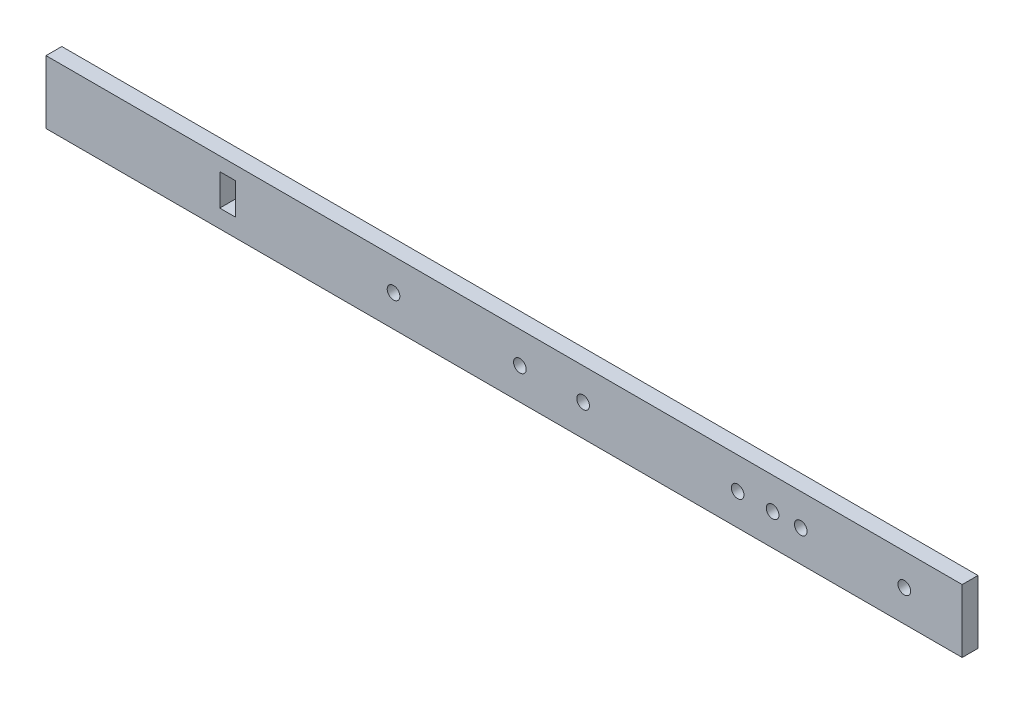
from build123d import *

# Parameters (mm, degrees)
SKETCH1_W           = 290
SKETCH1_H           = 20
BOSS_EXTRUDE1_DEPTH = 5
SKETCH2_R           = 2
SKETCH2_W           = 5
SKETCH2_H           = 10
CUT_EXTRUDE1_DEPTH  = 5


with BuildPart() as part:
    # Sketch1 → Boss-Extrude1 (new body)
    with BuildSketch(Plane.XY):
        with Locations((35, 0)):
            Rectangle(SKETCH1_W, SKETCH1_H)
    extrude(amount=BOSS_EXTRUDE1_DEPTH)

    # Sketch2 → Cut-Extrude1 (cut)
    with BuildSketch(Plane.XY.offset(5)):
        Circle(SKETCH2_R)
        with Locations((128.9104104, 0)):
            Circle(SKETCH2_R)
        with Locations((60, 0)):
            Circle(SKETCH2_R)
        with Locations((40, 0)):
            Circle(SKETCH2_R)
        with Locations((120, 0)):
            Circle(SKETCH2_R)
        with Locations((108.9104104, 0)):
            Circle(SKETCH2_R)
        with Locations((161.6668644, 0)):
            Circle(SKETCH2_R)
        with Locations((-52.5, 0.698778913)):
            Rectangle(SKETCH2_W, SKETCH2_H)
    extrude(amount=-CUT_EXTRUDE1_DEPTH, mode=Mode.SUBTRACT)


solid = part.part
